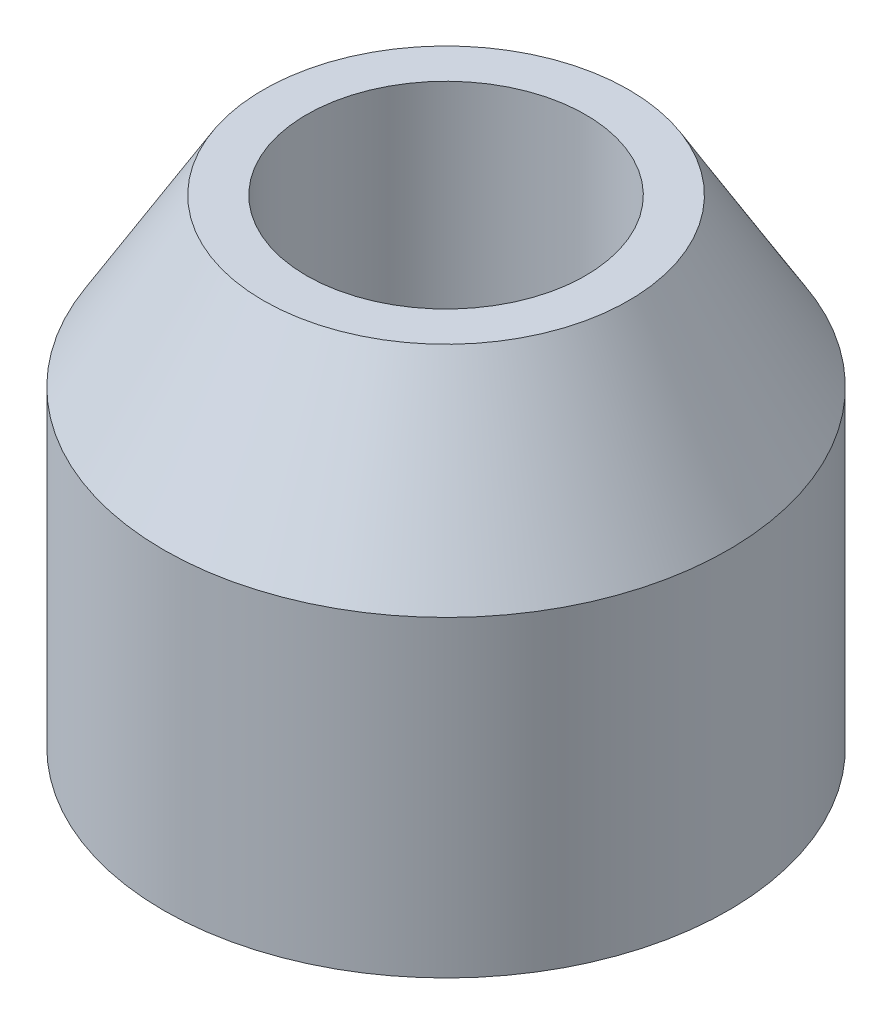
from build123d import *

# Parameters (mm, degrees)
SKETCH_1_R      = 4.25
SKETCH_1_R_2    = 2.1
EXTRUDE_1_DEPTH = 7.2
CHAMFER_1_SIZE  = 2.5
CHAMFER_1_SIZE2 = 1.5


with BuildPart() as part:
    # Sketch 1 → Extrude 1 (new body)
    with BuildSketch(Plane(origin=(0, 0, 0), x_dir=(1, 0, 0), z_dir=(0, 1, 0))):
        with Locations(Location((0, 0, 0), (0, 0, 270))):
            Circle(SKETCH_1_R)
        with Locations(Location((0, 0, 0), (0, 0, 270))):
            Circle(SKETCH_1_R_2, mode=Mode.SUBTRACT)
    extrude(amount=EXTRUDE_1_DEPTH)

    # Chamfer 1
    chamfer_1_edges = [part.edges().sort_by_distance(p)[0] for p in [
        (0, 7.2, -4.25),
    ]]
    chamfer_1_side = [part.faces().sort_by_distance(p)[0] for p in [
        (0, 3.6, -4.25),
    ]]
    chamfer(chamfer_1_edges, length=CHAMFER_1_SIZE, length2=CHAMFER_1_SIZE2, reference=chamfer_1_side[0])


solid = part.part
